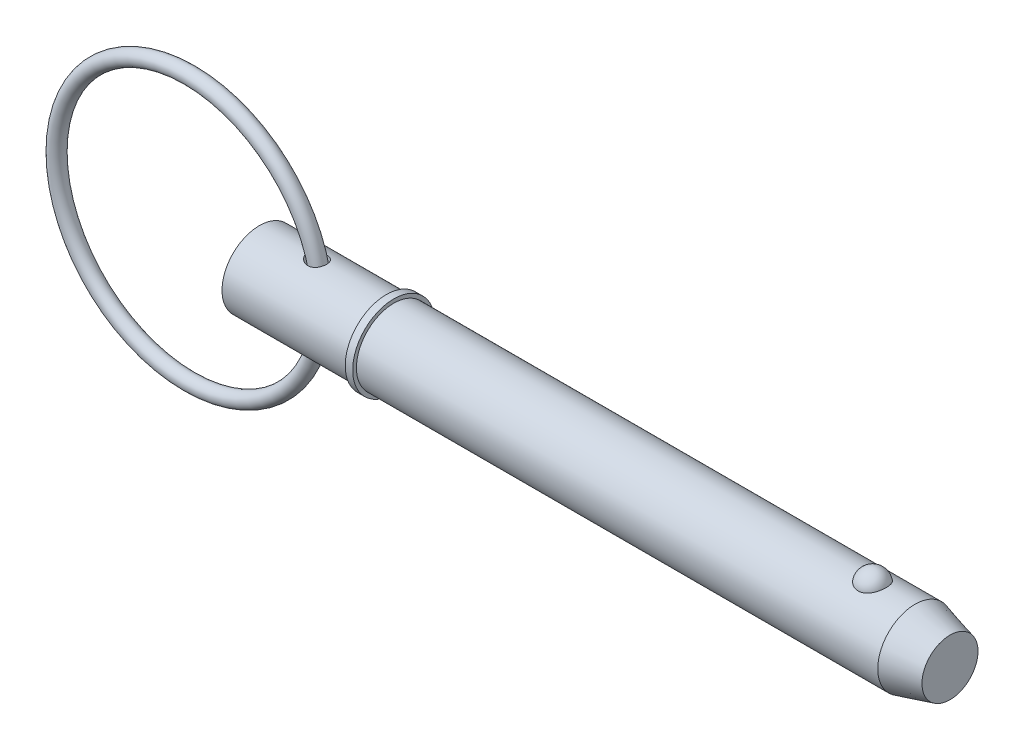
ISO-10303-21;
HEADER;
FILE_DESCRIPTION(('STEP AP214'),'2;1');
FILE_NAME('part.step','',(''),(''),'','','');
FILE_SCHEMA(('AUTOMOTIVE_DESIGN { 1 0 10303 214 1 1 1 1 }'));
ENDSEC;
DATA;
#1=APPLICATION_CONTEXT('core data for automotive mechanical design processes');
#2=APPLICATION_PROTOCOL_DEFINITION('international standard','automotive_design',2000,#1);
#3=PRODUCT_CONTEXT('',#1,'mechanical');
#4=PRODUCT('Part','Part','',(#3));
#5=PRODUCT_RELATED_PRODUCT_CATEGORY('part','',(#4));
#6=PRODUCT_DEFINITION_FORMATION('','',#4);
#7=PRODUCT_DEFINITION_CONTEXT('part definition',#1,'design');
#8=PRODUCT_DEFINITION('design','',#6,#7);
#9=PRODUCT_DEFINITION_SHAPE('','',#8);
#10=(LENGTH_UNIT() NAMED_UNIT(*) SI_UNIT(.MILLI.,.METRE.));
#11=(NAMED_UNIT(*) PLANE_ANGLE_UNIT() SI_UNIT($,.RADIAN.));
#12=(NAMED_UNIT(*) SI_UNIT($,.STERADIAN.) SOLID_ANGLE_UNIT());
#13=UNCERTAINTY_MEASURE_WITH_UNIT(LENGTH_MEASURE(1.E-05),#10,'distance_accuracy_value','');
#14=(GEOMETRIC_REPRESENTATION_CONTEXT(3) GLOBAL_UNCERTAINTY_ASSIGNED_CONTEXT((#13)) GLOBAL_UNIT_ASSIGNED_CONTEXT((#10,
#11,#12)) REPRESENTATION_CONTEXT('',''));
#15=CARTESIAN_POINT('',(0.,0.,0.));
#16=DIRECTION('',(0.,0.,1.));
#17=DIRECTION('',(1.,0.,0.));
#18=AXIS2_PLACEMENT_3D('',#15,#16,#17);
#19=CARTESIAN_POINT('',(-13.3805387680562,0.,0.));
#20=DIRECTION('',(0.,0.,1.));
#21=DIRECTION('',(1.,0.,0.));
#22=AXIS2_PLACEMENT_3D('',#19,#20,#21);
#23=TOROIDAL_SURFACE('',#22,25.4,1.429);
#24=CARTESIAN_POINT('',(13.4484612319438,0.,0.));
#25=VERTEX_POINT('',#24);
#26=VERTEX_LOOP('',#25);
#27=FACE_BOUND('',#26,.T.);
#28=ADVANCED_FACE('P0_F12',(#27),#23,.T.);
#29=CLOSED_SHELL('',(#28));
#30=MANIFOLD_SOLID_BREP('P0_B1',#29);
#31=CARTESIAN_POINT('',(0.,0.,0.));
#32=DIRECTION('',(1.,0.,0.));
#33=DIRECTION('',(0.,0.,-1.));
#34=AXIS2_PLACEMENT_3D('',#31,#32,#33);
#35=CYLINDRICAL_SURFACE('',#34,7.145);
#36=CARTESIAN_POINT('',(9.43029029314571,7.0820748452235,-0.946171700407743));
#37=CARTESIAN_POINT('',(9.49289741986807,7.07004660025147,-1.03619677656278));
#38=CARTESIAN_POINT('',(9.56370593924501,7.05703049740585,-1.12049617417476));
#39=CARTESIAN_POINT('',(9.71869321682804,7.03060933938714,-1.27585605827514));
#40=CARTESIAN_POINT('',(9.80290151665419,7.01720347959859,-1.34688652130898));
#41=CARTESIAN_POINT('',(9.98160385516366,6.99158714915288,-1.47408585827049));
#42=CARTESIAN_POINT('',(10.0760626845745,6.97937284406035,-1.53030346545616));
#43=CARTESIAN_POINT('',(10.2729508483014,6.95747410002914,-1.62697341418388));
#44=CARTESIAN_POINT('',(10.3753769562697,6.9477886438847,-1.66743209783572));
#45=CARTESIAN_POINT('',(10.5898946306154,6.93181594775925,-1.73266776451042));
#46=CARTESIAN_POINT('',(10.7022085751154,6.92567913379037,-1.75675727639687));
#47=CARTESIAN_POINT('',(10.9294935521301,6.91839634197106,-1.78523005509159));
#48=CARTESIAN_POINT('',(11.0444638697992,6.91724903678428,-1.78961856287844));
#49=CARTESIAN_POINT('',(11.2673249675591,6.92023954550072,-1.77801517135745));
#50=CARTESIAN_POINT('',(11.3752729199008,6.9241055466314,-1.7630715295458));
#51=CARTESIAN_POINT('',(11.5865707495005,6.93632220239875,-1.71437618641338));
#52=CARTESIAN_POINT('',(11.6899227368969,6.94467077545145,-1.68063321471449));
#53=CARTESIAN_POINT('',(11.8814537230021,6.96412118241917,-1.59802791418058));
#54=CARTESIAN_POINT('',(11.9701885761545,6.97498839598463,-1.55039425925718));
#55=CARTESIAN_POINT('',(12.1379548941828,6.99847346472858,-1.44066970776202));
#56=CARTESIAN_POINT('',(12.216987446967,7.01109112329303,-1.37858043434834));
#57=CARTESIAN_POINT('',(12.3614636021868,7.03632910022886,-1.24326778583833));
#58=CARTESIAN_POINT('',(12.4271729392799,7.04894297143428,-1.17032635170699));
#59=CARTESIAN_POINT('',(12.5455377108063,7.07306867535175,-1.01436746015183));
#60=CARTESIAN_POINT('',(12.5981928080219,7.08458047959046,-0.931349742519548));
#61=CARTESIAN_POINT('',(12.6896059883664,7.10535787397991,-0.75677050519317));
#62=CARTESIAN_POINT('',(12.7282356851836,7.11460247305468,-0.665139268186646));
#63=CARTESIAN_POINT('',(12.7900431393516,7.12971795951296,-0.476541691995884));
#64=CARTESIAN_POINT('',(12.8132203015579,7.13558871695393,-0.379575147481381));
#65=CARTESIAN_POINT('',(12.843715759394,7.14336270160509,-0.182249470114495));
#66=CARTESIAN_POINT('',(12.8509095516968,7.14523477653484,-0.0818698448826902));
#67=CARTESIAN_POINT('',(12.8489064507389,7.14471772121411,0.11871563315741));
#68=CARTESIAN_POINT('',(12.8397092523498,7.14232851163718,0.218921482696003));
#69=CARTESIAN_POINT('',(12.8051110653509,7.13353949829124,0.416446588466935));
#70=CARTESIAN_POINT('',(12.7796895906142,7.12713462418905,0.51376203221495));
#71=CARTESIAN_POINT('',(12.7132079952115,7.1110024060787,0.702607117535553));
#72=CARTESIAN_POINT('',(12.6721476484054,7.10127501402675,0.794136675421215));
#73=CARTESIAN_POINT('',(12.5754142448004,7.07957648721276,0.9686879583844));
#74=CARTESIAN_POINT('',(12.5197583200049,7.06760798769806,1.05171950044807));
#75=CARTESIAN_POINT('',(12.3951873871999,7.04275315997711,1.20699878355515));
#76=CARTESIAN_POINT('',(12.3262733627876,7.02986689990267,1.27924732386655));
#77=CARTESIAN_POINT('',(12.1775943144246,7.00473797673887,1.41035599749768));
#78=CARTESIAN_POINT('',(12.0979195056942,6.99249102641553,1.46931758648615));
#79=CARTESIAN_POINT('',(11.9295314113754,6.96991222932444,1.57295053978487));
#80=CARTESIAN_POINT('',(11.840819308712,6.9595801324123,1.61762377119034));
#81=CARTESIAN_POINT('',(11.6577653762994,6.94204625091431,1.69128599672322));
#82=CARTESIAN_POINT('',(11.5634812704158,6.93481718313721,1.72041226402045));
#83=CARTESIAN_POINT('',(11.3712731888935,6.92407027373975,1.76316901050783));
#84=CARTESIAN_POINT('',(11.2733489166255,6.92055273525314,1.7767982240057));
#85=CARTESIAN_POINT('',(11.0745092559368,6.91745053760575,1.78883853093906));
#86=CARTESIAN_POINT('',(10.9735737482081,6.91794816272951,1.7869312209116));
#87=CARTESIAN_POINT('',(10.7732766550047,6.92286647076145,1.76777696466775));
#88=CARTESIAN_POINT('',(10.6739155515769,6.92728833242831,1.75052540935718));
#89=CARTESIAN_POINT('',(10.4726907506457,6.93987626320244,1.69995986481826));
#90=CARTESIAN_POINT('',(10.3710860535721,6.94826759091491,1.66567223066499));
#91=CARTESIAN_POINT('',(10.1746512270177,6.96783543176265,1.5818155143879));
#92=CARTESIAN_POINT('',(10.0798244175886,6.97901329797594,1.53223900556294));
#93=CARTESIAN_POINT('',(9.89353725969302,7.00369413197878,1.41530336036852));
#94=CARTESIAN_POINT('',(9.80266896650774,7.01729943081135,1.34701798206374));
#95=CARTESIAN_POINT('',(9.63408859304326,7.0446567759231,1.19571433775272));
#96=CARTESIAN_POINT('',(9.55637809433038,7.05840883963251,1.11269430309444));
#97=CARTESIAN_POINT('',(9.41909992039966,7.083998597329,0.935821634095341));
#98=CARTESIAN_POINT('',(9.3591283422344,7.09587546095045,0.842290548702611));
#99=CARTESIAN_POINT('',(9.25811978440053,7.11649414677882,0.645207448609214));
#100=CARTESIAN_POINT('',(9.2170578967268,7.12524008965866,0.541668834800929));
#101=CARTESIAN_POINT('',(9.16044503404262,7.13745944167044,0.341322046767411));
#102=CARTESIAN_POINT('',(9.14237352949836,7.14144984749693,0.24525723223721));
#103=CARTESIAN_POINT('',(9.12416132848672,7.14547143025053,0.0513577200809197));
#104=CARTESIAN_POINT('',(9.12401221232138,7.14550446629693,-0.0464761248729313));
#105=CARTESIAN_POINT('',(9.14075660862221,7.14180686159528,-0.230866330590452));
#106=CARTESIAN_POINT('',(9.15598246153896,7.13844450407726,-0.317588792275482));
#107=CARTESIAN_POINT('',(9.20015637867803,7.1288735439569,-0.487231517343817));
#108=CARTESIAN_POINT('',(9.22909411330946,7.12266708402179,-0.570154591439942));
#109=CARTESIAN_POINT('',(9.2869632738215,7.11060500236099,-0.702183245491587));
#110=CARTESIAN_POINT('',(9.31233771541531,7.10538970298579,-0.752949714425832));
#111=CARTESIAN_POINT('',(9.36784352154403,7.09422889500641,-0.85170964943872));
#112=CARTESIAN_POINT('',(9.39797435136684,7.08828346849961,-0.899703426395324));
#113=CARTESIAN_POINT('',(9.43029029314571,7.0820748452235,-0.946171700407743));
#114=B_SPLINE_CURVE_WITH_KNOTS('',3,(#36,#37,#38,#39,#40,#41,#42,#43,#44,#45,#46,#47,#48,#49,
#50,#51,#52,#53,#54,#55,#56,#57,#58,#59,#60,#61,#62,#63,#64,#65,#66,#67,#68,#69,#70,#71,#72,#73,
#74,#75,#76,#77,#78,#79,#80,#81,#82,#83,#84,#85,#86,#87,#88,#89,#90,#91,#92,#93,#94,#95,#96,#97,
#98,#99,#100,#101,#102,#103,#104,#105,#106,#107,#108,#109,#110,#111,#112,#113),.UNSPECIFIED.,
.T.,.F.,(4,2,2,2,2,2,2,2,2,2,2,2,2,2,2,2,2,2,2,2,2,2,2,2,2,2,2,2,2,2,2,2,2,2,2,2,2,2,4),(0.,
0.330712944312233,0.662165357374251,0.992513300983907,1.32272815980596,1.66607248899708,
2.00932547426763,2.33472339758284,2.65997034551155,2.96236844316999,3.26473260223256,
3.56029376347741,3.85586255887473,4.15407251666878,4.45229395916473,4.75283038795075,
5.05337241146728,5.35429467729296,5.6552212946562,5.95579625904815,6.25634893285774,
6.55452242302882,6.85265693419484,7.14811357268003,7.44359434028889,7.74514565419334,
8.04678757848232,8.368090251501,8.68954924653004,9.03133562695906,9.37316306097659,
9.70647113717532,10.0393389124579,10.3311793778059,10.6228827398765,10.8860177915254,
11.1489549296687,11.3196783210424,11.4903825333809),.UNSPECIFIED.);
#115=CARTESIAN_POINT('',(9.43029029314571,7.0820748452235,-0.946171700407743));
#116=VERTEX_POINT('',#115);
#117=EDGE_CURVE('P1_E42',#116,#116,#114,.T.);
#118=ORIENTED_EDGE('',*,*,#117,.T.);
#119=EDGE_LOOP('',(#118));
#120=FACE_BOUND('',#119,.T.);
#121=CARTESIAN_POINT('',(0.,0.,0.));
#122=DIRECTION('',(1.,0.,0.));
#123=DIRECTION('',(0.,0.,-1.));
#124=AXIS2_PLACEMENT_3D('',#121,#122,#123);
#125=CIRCLE('',#124,7.145);
#126=CARTESIAN_POINT('',(0.,0.,-7.145));
#127=VERTEX_POINT('',#126);
#128=EDGE_CURVE('P1_E9',#127,#127,#125,.T.);
#129=ORIENTED_EDGE('',*,*,#128,.T.);
#130=EDGE_LOOP('',(#129));
#131=FACE_BOUND('',#130,.T.);
#132=CARTESIAN_POINT('',(24.271,0.,0.));
#133=DIRECTION('',(1.,0.,0.));
#134=DIRECTION('',(0.,0.,-1.));
#135=AXIS2_PLACEMENT_3D('',#132,#133,#134);
#136=CIRCLE('',#135,7.145);
#137=CARTESIAN_POINT('',(24.271,0.,-7.145));
#138=VERTEX_POINT('',#137);
#139=EDGE_CURVE('P1_E25',#138,#138,#136,.T.);
#140=ORIENTED_EDGE('',*,*,#139,.F.);
#141=EDGE_LOOP('',(#140));
#142=FACE_BOUND('',#141,.T.);
#143=CARTESIAN_POINT('',(9.43029029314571,-7.0820748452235,-0.946171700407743));
#144=CARTESIAN_POINT('',(9.37760063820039,-7.09219753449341,-0.870403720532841));
#145=CARTESIAN_POINT('',(9.33068640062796,-7.10162619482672,-0.790535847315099));
#146=CARTESIAN_POINT('',(9.25028000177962,-7.11818229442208,-0.624083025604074));
#147=CARTESIAN_POINT('',(9.21677847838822,-7.12531133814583,-0.537502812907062));
#148=CARTESIAN_POINT('',(9.16475883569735,-7.13651886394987,-0.359324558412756));
#149=CARTESIAN_POINT('',(9.14630423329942,-7.14058440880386,-0.267706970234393));
#150=CARTESIAN_POINT('',(9.12573334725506,-7.14512216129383,-0.0825612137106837));
#151=CARTESIAN_POINT('',(9.12361335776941,-7.1455951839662,0.0109665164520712));
#152=CARTESIAN_POINT('',(9.13548667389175,-7.14296952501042,0.191627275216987));
#153=CARTESIAN_POINT('',(9.14858103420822,-7.14007009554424,0.278824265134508));
#154=CARTESIAN_POINT('',(9.18869656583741,-7.1313430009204,0.449782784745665));
#155=CARTESIAN_POINT('',(9.21571947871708,-7.1255149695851,0.533543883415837));
#156=CARTESIAN_POINT('',(9.282939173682,-7.11140544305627,0.696984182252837));
#157=CARTESIAN_POINT('',(9.32334793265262,-7.10308469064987,0.7765721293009));
#158=CARTESIAN_POINT('',(9.41555290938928,-7.08481187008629,0.928623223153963));
#159=CARTESIAN_POINT('',(9.4673531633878,-7.07485922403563,1.00108383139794));
#160=CARTESIAN_POINT('',(9.58690514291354,-7.05302654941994,1.14530893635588));
#161=CARTESIAN_POINT('',(9.65578345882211,-7.04105486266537,1.21612477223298));
#162=CARTESIAN_POINT('',(9.80342908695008,-7.01727063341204,1.34660507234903));
#163=CARTESIAN_POINT('',(9.88220203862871,-7.00545818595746,1.40626312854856));
#164=CARTESIAN_POINT('',(10.0573217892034,-6.98177399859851,1.51973713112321));
#165=CARTESIAN_POINT('',(10.1546474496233,-6.9700532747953,1.57208037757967));
#166=CARTESIAN_POINT('',(10.3567277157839,-6.94950828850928,1.66055104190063));
#167=CARTESIAN_POINT('',(10.4614845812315,-6.94068491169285,1.69667350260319));
#168=CARTESIAN_POINT('',(10.6792116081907,-6.92685379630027,1.75230777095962));
#169=CARTESIAN_POINT('',(10.7923373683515,-6.92197732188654,1.77125049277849));
#170=CARTESIAN_POINT('',(11.0202699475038,-6.91736328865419,1.78919210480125));
#171=CARTESIAN_POINT('',(11.1350759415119,-6.91762328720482,1.78820047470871));
#172=CARTESIAN_POINT('',(11.355627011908,-6.92328130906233,1.76615765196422));
#173=CARTESIAN_POINT('',(11.4615007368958,-6.92836826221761,1.74632083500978));
#174=CARTESIAN_POINT('',(11.6678083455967,-6.94272508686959,1.68833625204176));
#175=CARTESIAN_POINT('',(11.7682443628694,-6.9519933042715,1.65019572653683));
#176=CARTESIAN_POINT('',(11.9539217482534,-6.97285816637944,1.55957439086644));
#177=CARTESIAN_POINT('',(12.0397280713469,-6.98426147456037,1.50820229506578));
#178=CARTESIAN_POINT('',(12.2011249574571,-7.00842344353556,1.39160266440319));
#179=CARTESIAN_POINT('',(12.276716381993,-7.0211819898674,1.32637629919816));
#180=CARTESIAN_POINT('',(12.4144868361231,-7.04639315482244,1.18508369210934));
#181=CARTESIAN_POINT('',(12.4768620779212,-7.05884739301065,1.10920872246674));
#182=CARTESIAN_POINT('',(12.5881779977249,-7.08230185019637,0.947973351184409));
#183=CARTESIAN_POINT('',(12.6371182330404,-7.09330202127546,0.862612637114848));
#184=CARTESIAN_POINT('',(12.7208404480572,-7.11277016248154,0.68387168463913));
#185=CARTESIAN_POINT('',(12.7554736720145,-7.12121129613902,0.590418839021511));
#186=CARTESIAN_POINT('',(12.8090653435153,-7.13450309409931,0.398877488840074));
#187=CARTESIAN_POINT('',(12.8280232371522,-7.13935363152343,0.300788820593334));
#188=CARTESIAN_POINT('',(12.8499077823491,-7.14496695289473,0.102058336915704));
#189=CARTESIAN_POINT('',(12.8527265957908,-7.14570223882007,0.00140385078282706));
#190=CARTESIAN_POINT('',(12.8419792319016,-7.14293198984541,-0.198968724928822));
#191=CARTESIAN_POINT('',(12.8284127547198,-7.13942637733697,-0.298686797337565));
#192=CARTESIAN_POINT('',(12.7851853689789,-7.12854635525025,-0.494442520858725));
#193=CARTESIAN_POINT('',(12.7555107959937,-7.12116866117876,-0.590476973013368));
#194=CARTESIAN_POINT('',(12.6807437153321,-7.10334272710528,-0.776042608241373));
#195=CARTESIAN_POINT('',(12.6356510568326,-7.09289445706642,-0.865573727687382));
#196=CARTESIAN_POINT('',(12.5312128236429,-7.07009703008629,-1.03541867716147));
#197=CARTESIAN_POINT('',(12.4718917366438,-7.0577511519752,-1.11574799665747));
#198=CARTESIAN_POINT('',(12.3404461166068,-7.03252701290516,-1.26504204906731));
#199=CARTESIAN_POINT('',(12.2683227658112,-7.01964880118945,-1.3340078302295));
#200=CARTESIAN_POINT('',(12.1139052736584,-6.99493588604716,-1.45803732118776));
#201=CARTESIAN_POINT('',(12.031708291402,-6.98309284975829,-1.51322032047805));
#202=CARTESIAN_POINT('',(11.858962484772,-6.96164945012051,-1.60900039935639));
#203=CARTESIAN_POINT('',(11.7684146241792,-6.95204882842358,-1.6495991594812));
#204=CARTESIAN_POINT('',(11.5822744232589,-6.93618392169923,-1.71508374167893));
#205=CARTESIAN_POINT('',(11.4867225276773,-6.92989640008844,-1.74007923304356));
#206=CARTESIAN_POINT('',(11.292703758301,-6.92114809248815,-1.77455680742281));
#207=CARTESIAN_POINT('',(11.1942365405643,-6.91868775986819,-1.7840370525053));
#208=CARTESIAN_POINT('',(10.9943797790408,-6.91771041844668,-1.78782317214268));
#209=CARTESIAN_POINT('',(10.8929824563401,-6.9193005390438,-1.78171679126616));
#210=CARTESIAN_POINT('',(10.6924353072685,-6.92632816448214,-1.75419409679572));
#211=CARTESIAN_POINT('',(10.5932861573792,-6.93176681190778,-1.73277323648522));
#212=CARTESIAN_POINT('',(10.3927770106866,-6.94630717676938,-1.67356884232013));
#213=CARTESIAN_POINT('',(10.2917367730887,-6.95563581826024,-1.63475796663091));
#214=CARTESIAN_POINT('',(10.0971768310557,-6.97681957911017,-1.54184188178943));
#215=CARTESIAN_POINT('',(10.0036623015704,-6.9886764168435,-1.48772626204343));
#216=CARTESIAN_POINT('',(9.82098935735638,-7.01440230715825,-1.36146688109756));
#217=CARTESIAN_POINT('',(9.73247440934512,-7.0283510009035,-1.28840361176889));
#218=CARTESIAN_POINT('',(9.56978695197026,-7.05591334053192,-1.12770855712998));
#219=CARTESIAN_POINT('',(9.49560170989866,-7.06952727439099,-1.0400898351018));
#220=CARTESIAN_POINT('',(9.43029029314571,-7.0820748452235,-0.946171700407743));
#221=B_SPLINE_CURVE_WITH_KNOTS('',3,(#143,#144,#145,#146,#147,#148,#149,#150,#151,#152,#153,
#154,#155,#156,#157,#158,#159,#160,#161,#162,#163,#164,#165,#166,#167,#168,#169,#170,#171,#172,
#173,#174,#175,#176,#177,#178,#179,#180,#181,#182,#183,#184,#185,#186,#187,#188,#189,#190,#191,
#192,#193,#194,#195,#196,#197,#198,#199,#200,#201,#202,#203,#204,#205,#206,#207,#208,#209,#210,
#211,#212,#213,#214,#215,#216,#217,#218,#219,#220),.UNSPECIFIED.,.T.,.F.,(4,2,2,2,2,2,2,2,2,2,2,
2,2,2,2,2,2,2,2,2,2,2,2,2,2,2,2,2,2,2,2,2,2,2,2,2,2,2,4),(0.,0.278197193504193,
0.556199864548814,0.835370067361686,1.11447693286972,1.37789669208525,1.64134939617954,
1.9091912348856,2.17712812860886,2.4744625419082,2.77196719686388,3.10386520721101,
3.43586457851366,3.77849767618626,4.1209678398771,4.44276705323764,4.76443907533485,
5.06494526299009,5.36542609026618,5.6610728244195,5.95672929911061,6.25538683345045,
6.5540549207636,6.85471634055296,7.15538326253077,7.45630563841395,7.75723095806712,
8.05764204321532,8.35802540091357,8.65571107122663,8.95336242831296,9.24889743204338,
9.54446744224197,9.84793560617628,10.1514939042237,10.4760045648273,10.8007364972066,
11.1458836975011,11.4907227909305),.UNSPECIFIED.);
#222=CARTESIAN_POINT('',(9.43029029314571,-7.0820748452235,-0.946171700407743));
#223=VERTEX_POINT('',#222);
#224=EDGE_CURVE('P1_E17',#223,#223,#221,.T.);
#225=ORIENTED_EDGE('',*,*,#224,.T.);
#226=EDGE_LOOP('',(#225));
#227=FACE_BOUND('',#226,.T.);
#228=ADVANCED_FACE('P1_F13',(#120,#131,#142,#227),#35,.T.);
#229=CARTESIAN_POINT('',(0.,0.,0.));
#230=DIRECTION('',(1.,0.,0.));
#231=DIRECTION('',(0.,0.,-1.));
#232=AXIS2_PLACEMENT_3D('',#229,#230,#231);
#233=CYLINDRICAL_SURFACE('',#232,7.145);
#234=CARTESIAN_POINT('',(125.38362424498,0.,0.));
#235=DIRECTION('',(1.,0.,0.));
#236=DIRECTION('',(0.,0.,-1.));
#237=AXIS2_PLACEMENT_3D('',#234,#235,#236);
#238=CIRCLE('',#237,7.145);
#239=CARTESIAN_POINT('',(125.38362424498,0.,-7.145));
#240=VERTEX_POINT('',#239);
#241=EDGE_CURVE('P1_E99',#240,#240,#238,.T.);
#242=ORIENTED_EDGE('',*,*,#241,.F.);
#243=EDGE_LOOP('',(#242));
#244=FACE_BOUND('',#243,.T.);
#245=CARTESIAN_POINT('',(25.7,0.,0.));
#246=DIRECTION('',(1.,0.,0.));
#247=DIRECTION('',(0.,0.,-1.));
#248=AXIS2_PLACEMENT_3D('',#245,#246,#247);
#249=CIRCLE('',#248,7.145);
#250=CARTESIAN_POINT('',(25.7,0.,-7.145));
#251=VERTEX_POINT('',#250);
#252=EDGE_CURVE('P1_E96',#251,#251,#249,.T.);
#253=ORIENTED_EDGE('',*,*,#252,.T.);
#254=EDGE_LOOP('',(#253));
#255=FACE_BOUND('',#254,.T.);
#256=CARTESIAN_POINT('',(117.239503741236,6.60328629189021,2.72903557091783));
#257=CARTESIAN_POINT('',(117.098315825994,6.60329644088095,2.7290249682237));
#258=CARTESIAN_POINT('',(116.956883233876,6.60799490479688,2.71772840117));
#259=CARTESIAN_POINT('',(116.677955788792,6.62628236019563,2.6728193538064));
#260=CARTESIAN_POINT('',(116.540472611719,6.63989534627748,2.63914664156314));
#261=CARTESIAN_POINT('',(116.273889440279,6.67440775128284,2.55059642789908));
#262=CARTESIAN_POINT('',(116.144768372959,6.69528793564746,2.49577486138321));
#263=CARTESIAN_POINT('',(115.897869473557,6.74205585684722,2.36651799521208));
#264=CARTESIAN_POINT('',(115.780086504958,6.76794130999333,2.29209163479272));
#265=CARTESIAN_POINT('',(115.55516710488,6.82286177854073,2.12312937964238));
#266=CARTESIAN_POINT('',(115.448440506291,6.85196655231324,2.02807107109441));
#267=CARTESIAN_POINT('',(115.251918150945,6.90970232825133,1.82167822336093));
#268=CARTESIAN_POINT('',(115.162127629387,6.93833318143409,1.71033867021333));
#269=CARTESIAN_POINT('',(114.997667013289,6.9935167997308,1.46891951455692));
#270=CARTESIAN_POINT('',(114.923844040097,7.01992110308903,1.33822781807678));
#271=CARTESIAN_POINT('',(114.798088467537,7.06643385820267,1.06566567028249));
#272=CARTESIAN_POINT('',(114.74615735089,7.08654188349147,0.923794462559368));
#273=CARTESIAN_POINT('',(114.664732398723,7.11862399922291,0.630993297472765));
#274=CARTESIAN_POINT('',(114.635516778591,7.13049704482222,0.479974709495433));
#275=CARTESIAN_POINT('',(114.601174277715,7.14449484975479,0.174782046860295));
#276=CARTESIAN_POINT('',(114.596046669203,7.14661990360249,0.0206080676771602));
#277=CARTESIAN_POINT('',(114.609938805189,7.14092465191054,-0.285506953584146));
#278=CARTESIAN_POINT('',(114.628810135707,7.1331654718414,-0.43745589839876));
#279=CARTESIAN_POINT('',(114.690062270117,7.10859076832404,-0.735778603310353));
#280=CARTESIAN_POINT('',(114.732443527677,7.0917750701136,-0.882152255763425));
#281=CARTESIAN_POINT('',(114.839934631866,7.05076716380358,-1.165431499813));
#282=CARTESIAN_POINT('',(114.905075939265,7.02656475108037,-1.30232366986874));
#283=CARTESIAN_POINT('',(115.056759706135,6.97329145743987,-1.56265907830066));
#284=CARTESIAN_POINT('',(115.143303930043,6.94422017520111,-1.68610120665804));
#285=CARTESIAN_POINT('',(115.336465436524,6.88415108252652,-1.91671004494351));
#286=CARTESIAN_POINT('',(115.443180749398,6.85314438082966,-2.02379244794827));
#287=CARTESIAN_POINT('',(115.673974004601,6.79282069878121,-2.21787433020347));
#288=CARTESIAN_POINT('',(115.798050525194,6.76350358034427,-2.30487545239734));
#289=CARTESIAN_POINT('',(116.057678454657,6.71060580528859,-2.45458647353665));
#290=CARTESIAN_POINT('',(116.192938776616,6.68691885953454,-2.51776240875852));
#291=CARTESIAN_POINT('',(116.473277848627,6.64741247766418,-2.62030218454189));
#292=CARTESIAN_POINT('',(116.618352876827,6.63159007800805,-2.65967499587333));
#293=CARTESIAN_POINT('',(116.906347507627,6.61038594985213,-2.71193301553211));
#294=CARTESIAN_POINT('',(117.04900807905,6.60451880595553,-2.72605165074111));
#295=CARTESIAN_POINT('',(117.334800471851,6.60240611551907,-2.73116688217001));
#296=CARTESIAN_POINT('',(117.477932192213,6.60615862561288,-2.7221681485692));
#297=CARTESIAN_POINT('',(117.755848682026,6.6225609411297,-2.68200435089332));
#298=CARTESIAN_POINT('',(117.890754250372,6.63492533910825,-2.65154998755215));
#299=CARTESIAN_POINT('',(118.15332009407,6.66687445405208,-2.57015684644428));
#300=CARTESIAN_POINT('',(118.28097978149,6.68645975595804,-2.51921640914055));
#301=CARTESIAN_POINT('',(118.528577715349,6.73127274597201,-2.39693610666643));
#302=CARTESIAN_POINT('',(118.648287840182,6.7566138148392,-2.32517694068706));
#303=CARTESIAN_POINT('',(118.874159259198,6.8100600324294,-2.1636381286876));
#304=CARTESIAN_POINT('',(118.980317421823,6.83816581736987,-2.07385432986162));
#305=CARTESIAN_POINT('',(119.181862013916,6.89580469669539,-1.87357235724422));
#306=CARTESIAN_POINT('',(119.276440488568,6.92533863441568,-1.76226074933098));
#307=CARTESIAN_POINT('',(119.446332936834,6.98139526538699,-1.52511696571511));
#308=CARTESIAN_POINT('',(119.521643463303,7.0079174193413,-1.39928219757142));
#309=CARTESIAN_POINT('',(119.653595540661,7.05607625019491,-1.1321597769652));
#310=CARTESIAN_POINT('',(119.709568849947,7.07753119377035,-0.990508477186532));
#311=CARTESIAN_POINT('',(119.798296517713,7.11222355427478,-0.699154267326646));
#312=CARTESIAN_POINT('',(119.831050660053,7.12546089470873,-0.549451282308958));
#313=CARTESIAN_POINT('',(119.872689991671,7.1423758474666,-0.246120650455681));
#314=CARTESIAN_POINT('',(119.881558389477,7.14604673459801,-0.0924903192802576));
#315=CARTESIAN_POINT('',(119.875194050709,7.14343510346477,0.214181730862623));
#316=CARTESIAN_POINT('',(119.859961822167,7.13715279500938,0.367223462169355));
#317=CARTESIAN_POINT('',(119.805845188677,7.1153294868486,0.66759501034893));
#318=CARTESIAN_POINT('',(119.767077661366,7.09983424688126,0.814949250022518));
#319=CARTESIAN_POINT('',(119.666770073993,7.06119140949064,1.10063221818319));
#320=CARTESIAN_POINT('',(119.605228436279,7.03804328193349,1.23896032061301));
#321=CARTESIAN_POINT('',(119.460207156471,6.98632429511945,1.50352300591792));
#322=CARTESIAN_POINT('',(119.376606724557,6.95772382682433,1.62968561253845));
#323=CARTESIAN_POINT('',(119.18938046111,6.89823072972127,1.86554304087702));
#324=CARTESIAN_POINT('',(119.085755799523,6.86733823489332,1.97523882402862));
#325=CARTESIAN_POINT('',(118.861076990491,6.80676456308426,2.17482293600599));
#326=CARTESIAN_POINT('',(118.740067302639,6.7770805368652,2.26476035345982));
#327=CARTESIAN_POINT('',(118.483340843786,6.7223050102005,2.42252989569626));
#328=CARTESIAN_POINT('',(118.34761851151,6.69721525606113,2.49035362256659));
#329=CARTESIAN_POINT('',(118.070402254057,6.65552591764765,2.59967646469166));
#330=CARTESIAN_POINT('',(117.929281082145,6.63865794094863,2.64202017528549));
#331=CARTESIAN_POINT('',(117.641444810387,6.61425039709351,2.7025584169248));
#332=CARTESIAN_POINT('',(117.494748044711,6.606682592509,2.72082606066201));
#333=CARTESIAN_POINT('',(117.311679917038,6.60358754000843,2.72830331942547));
#334=CARTESIAN_POINT('',(117.275599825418,6.60328369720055,2.72903828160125));
#335=CARTESIAN_POINT('',(117.239503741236,6.60328629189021,2.72903557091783));
#336=B_SPLINE_CURVE_WITH_KNOTS('',3,(#256,#257,#258,#259,#260,#261,#262,#263,#264,#265,#266,
#267,#268,#269,#270,#271,#272,#273,#274,#275,#276,#277,#278,#279,#280,#281,#282,#283,#284,#285,
#286,#287,#288,#289,#290,#291,#292,#293,#294,#295,#296,#297,#298,#299,#300,#301,#302,#303,#304,
#305,#306,#307,#308,#309,#310,#311,#312,#313,#314,#315,#316,#317,#318,#319,#320,#321,#322,#323,
#324,#325,#326,#327,#328,#329,#330,#331,#332,#333,#334,#335),.UNSPECIFIED.,.T.,.F.,(4,2,2,2,2,2,
2,2,2,2,2,2,2,2,2,2,2,2,2,2,2,2,2,2,2,2,2,2,2,2,2,2,2,2,2,2,2,2,2,4),(0.,0.423468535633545,
0.848081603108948,1.27157926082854,1.69488414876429,2.13051395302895,2.56627819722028,
3.02136706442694,3.47648674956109,3.93709649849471,4.39769233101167,4.85545355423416,
5.31322361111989,5.77162895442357,6.23007210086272,6.69080337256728,7.15149693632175,
7.60264329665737,8.05361952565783,8.4818972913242,8.91008854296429,9.32472524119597,
9.73939553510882,10.1630783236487,10.5868588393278,11.0319070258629,11.4770347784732,
11.9362874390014,12.3955443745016,12.8551240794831,13.3146940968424,13.7720003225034,
14.2293382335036,14.6892343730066,15.1491036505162,15.6078171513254,16.0667046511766,
16.5093965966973,16.9507410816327,17.0590049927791),.UNSPECIFIED.);
#337=CARTESIAN_POINT('',(117.239503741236,6.60328629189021,2.72903557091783));
#338=VERTEX_POINT('',#337);
#339=EDGE_CURVE('P1_E34',#338,#338,#336,.T.);
#340=ORIENTED_EDGE('',*,*,#339,.T.);
#341=EDGE_LOOP('',(#340));
#342=FACE_BOUND('',#341,.T.);
#343=ADVANCED_FACE('P1_F46',(#244,#255,#342),#233,.T.);
#344=CARTESIAN_POINT('',(0.,0.,0.));
#345=DIRECTION('',(-1.,0.,0.));
#346=DIRECTION('',(0.,0.,1.));
#347=AXIS2_PLACEMENT_3D('',#344,#345,#346);
#348=PLANE('',#347);
#349=ORIENTED_EDGE('',*,*,#128,.F.);
#350=EDGE_LOOP('',(#349));
#351=FACE_BOUND('',#350,.T.);
#352=ADVANCED_FACE('P1_F15',(#351),#348,.T.);
#353=CARTESIAN_POINT('',(24.271,7.145,0.));
#354=DIRECTION('',(-1.,0.,0.));
#355=DIRECTION('',(0.,0.,1.));
#356=AXIS2_PLACEMENT_3D('',#353,#354,#355);
#357=PLANE('',#356);
#358=ORIENTED_EDGE('',*,*,#139,.T.);
#359=EDGE_LOOP('',(#358));
#360=FACE_BOUND('',#359,.T.);
#361=CARTESIAN_POINT('',(24.271,0.,0.));
#362=DIRECTION('',(1.,0.,0.));
#363=DIRECTION('',(0.,0.,-1.));
#364=AXIS2_PLACEMENT_3D('',#361,#362,#363);
#365=CIRCLE('',#364,7.8595);
#366=CARTESIAN_POINT('',(24.271,0.,-7.8595));
#367=VERTEX_POINT('',#366);
#368=EDGE_CURVE('P1_E30',#367,#367,#365,.T.);
#369=ORIENTED_EDGE('',*,*,#368,.F.);
#370=EDGE_LOOP('',(#369));
#371=FACE_BOUND('',#370,.T.);
#372=ADVANCED_FACE('P1_F81',(#360,#371),#357,.T.);
#373=CARTESIAN_POINT('',(0.,0.,0.));
#374=DIRECTION('',(1.,0.,0.));
#375=DIRECTION('',(0.,0.,-1.));
#376=AXIS2_PLACEMENT_3D('',#373,#374,#375);
#377=CYLINDRICAL_SURFACE('',#376,7.8595);
#378=ORIENTED_EDGE('',*,*,#368,.T.);
#379=EDGE_LOOP('',(#378));
#380=FACE_BOUND('',#379,.T.);
#381=CARTESIAN_POINT('',(25.7,0.,0.));
#382=DIRECTION('',(1.,0.,0.));
#383=DIRECTION('',(0.,0.,-1.));
#384=AXIS2_PLACEMENT_3D('',#381,#382,#383);
#385=CIRCLE('',#384,7.8595);
#386=CARTESIAN_POINT('',(25.7,0.,-7.8595));
#387=VERTEX_POINT('',#386);
#388=EDGE_CURVE('P1_E95',#387,#387,#385,.T.);
#389=ORIENTED_EDGE('',*,*,#388,.F.);
#390=EDGE_LOOP('',(#389));
#391=FACE_BOUND('',#390,.T.);
#392=ADVANCED_FACE('P1_F68',(#380,#391),#377,.T.);
#393=CARTESIAN_POINT('',(25.7,7.8595,0.));
#394=DIRECTION('',(1.,0.,0.));
#395=DIRECTION('',(0.,0.,-1.));
#396=AXIS2_PLACEMENT_3D('',#393,#394,#395);
#397=PLANE('',#396);
#398=ORIENTED_EDGE('',*,*,#388,.T.);
#399=EDGE_LOOP('',(#398));
#400=FACE_BOUND('',#399,.T.);
#401=ORIENTED_EDGE('',*,*,#252,.F.);
#402=EDGE_LOOP('',(#401));
#403=FACE_BOUND('',#402,.T.);
#404=ADVANCED_FACE('P1_F62',(#400,#403),#397,.T.);
#405=CARTESIAN_POINT('',(132.05,0.,0.));
#406=DIRECTION('',(-1.,0.,0.));
#407=DIRECTION('',(0.,0.,1.));
#408=AXIS2_PLACEMENT_3D('',#405,#406,#407);
#409=CONICAL_SURFACE('',#408,5.35875000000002,0.26179938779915);
#410=ORIENTED_EDGE('',*,*,#241,.T.);
#411=EDGE_LOOP('',(#410));
#412=FACE_BOUND('',#411,.T.);
#413=CARTESIAN_POINT('',(132.05,0.,0.));
#414=DIRECTION('',(1.,0.,0.));
#415=DIRECTION('',(0.,0.,-1.));
#416=AXIS2_PLACEMENT_3D('',#413,#414,#415);
#417=CIRCLE('',#416,5.35875000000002);
#418=CARTESIAN_POINT('',(132.05,0.,-5.35875000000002));
#419=VERTEX_POINT('',#418);
#420=EDGE_CURVE('P1_E41',#419,#419,#417,.T.);
#421=ORIENTED_EDGE('',*,*,#420,.F.);
#422=EDGE_LOOP('',(#421));
#423=FACE_BOUND('',#422,.T.);
#424=ADVANCED_FACE('P1_F59',(#412,#423),#409,.T.);
#425=CARTESIAN_POINT('',(132.05,5.35875000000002,0.));
#426=DIRECTION('',(1.,0.,0.));
#427=DIRECTION('',(0.,0.,-1.));
#428=AXIS2_PLACEMENT_3D('',#425,#426,#427);
#429=PLANE('',#428);
#430=ORIENTED_EDGE('',*,*,#420,.T.);
#431=EDGE_LOOP('',(#430));
#432=FACE_BOUND('',#431,.T.);
#433=ADVANCED_FACE('P1_F55',(#432),#429,.T.);
#434=CARTESIAN_POINT('',(117.239503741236,6.4305,0.));
#435=DIRECTION('',(-1.,0.,0.));
#436=DIRECTION('',(0.,1.,0.));
#437=AXIS2_PLACEMENT_3D('',#434,#435,#436);
#438=SPHERICAL_SURFACE('',#437,2.7345);
#439=ORIENTED_EDGE('',*,*,#339,.F.);
#440=EDGE_LOOP('',(#439));
#441=FACE_BOUND('',#440,.T.);
#442=ADVANCED_FACE('P1_F50',(#441),#438,.T.);
#443=CARTESIAN_POINT('',(-13.3805387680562,0.,0.));
#444=DIRECTION('',(0.,0.,1.));
#445=DIRECTION('',(1.,0.,0.));
#446=AXIS2_PLACEMENT_3D('',#443,#444,#445);
#447=TOROIDAL_SURFACE('',#446,25.4,1.78625);
#448=ORIENTED_EDGE('',*,*,#224,.F.);
#449=EDGE_LOOP('',(#448));
#450=FACE_BOUND('',#449,.T.);
#451=ORIENTED_EDGE('',*,*,#117,.F.);
#452=EDGE_LOOP('',(#451));
#453=FACE_BOUND('',#452,.T.);
#454=ADVANCED_FACE('P1_F54',(#450,#453),#447,.F.);
#455=CLOSED_SHELL('',(#228,#343,#352,#372,#392,#404,#424,#433,#442,#454));
#456=MANIFOLD_SOLID_BREP('P1_B1',#455);
#457=ADVANCED_BREP_SHAPE_REPRESENTATION('',(#18,#30,#456),#14);
#458=SHAPE_DEFINITION_REPRESENTATION(#9,#457);
ENDSEC;
END-ISO-10303-21;
